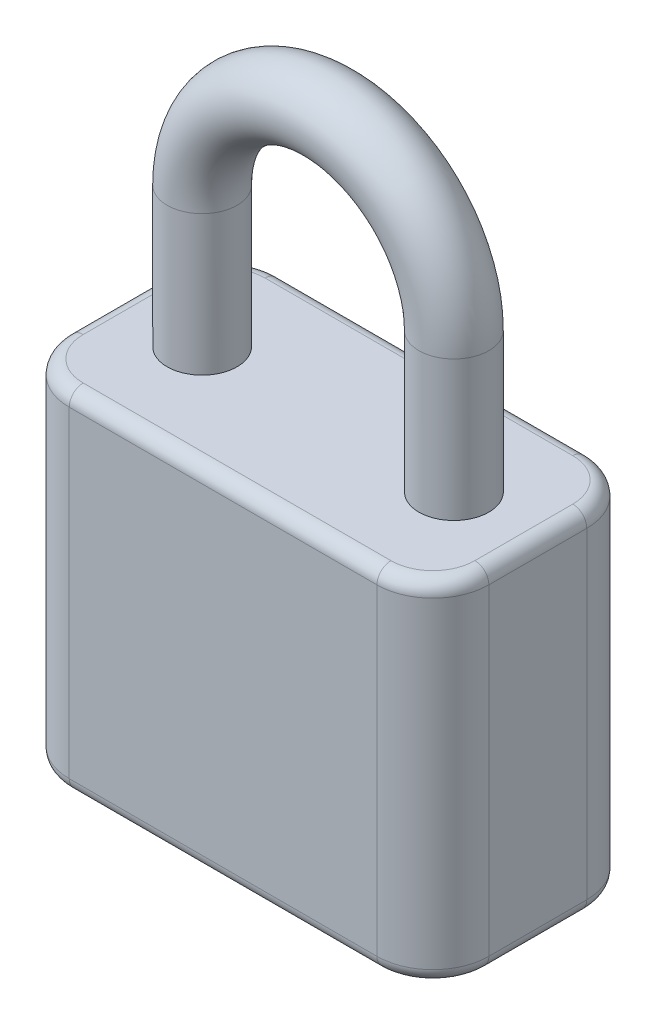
ISO-10303-21;
HEADER;
FILE_DESCRIPTION(('STEP AP214'),'2;1');
FILE_NAME('part.step','',(''),(''),'','','');
FILE_SCHEMA(('AUTOMOTIVE_DESIGN { 1 0 10303 214 1 1 1 1 }'));
ENDSEC;
DATA;
#1=APPLICATION_CONTEXT('core data for automotive mechanical design processes');
#2=APPLICATION_PROTOCOL_DEFINITION('international standard','automotive_design',2000,#1);
#3=PRODUCT_CONTEXT('',#1,'mechanical');
#4=PRODUCT('Part','Part','',(#3));
#5=PRODUCT_RELATED_PRODUCT_CATEGORY('part','',(#4));
#6=PRODUCT_DEFINITION_FORMATION('','',#4);
#7=PRODUCT_DEFINITION_CONTEXT('part definition',#1,'design');
#8=PRODUCT_DEFINITION('design','',#6,#7);
#9=PRODUCT_DEFINITION_SHAPE('','',#8);
#10=(LENGTH_UNIT() NAMED_UNIT(*) SI_UNIT(.MILLI.,.METRE.));
#11=(NAMED_UNIT(*) PLANE_ANGLE_UNIT() SI_UNIT($,.RADIAN.));
#12=(NAMED_UNIT(*) SI_UNIT($,.STERADIAN.) SOLID_ANGLE_UNIT());
#13=UNCERTAINTY_MEASURE_WITH_UNIT(LENGTH_MEASURE(1.E-05),#10,'distance_accuracy_value','');
#14=(GEOMETRIC_REPRESENTATION_CONTEXT(3) GLOBAL_UNCERTAINTY_ASSIGNED_CONTEXT((#13)) GLOBAL_UNIT_ASSIGNED_CONTEXT((#10,
#11,#12)) REPRESENTATION_CONTEXT('',''));
#15=CARTESIAN_POINT('',(0.,0.,0.));
#16=DIRECTION('',(0.,0.,1.));
#17=DIRECTION('',(1.,0.,0.));
#18=AXIS2_PLACEMENT_3D('',#15,#16,#17);
#19=CARTESIAN_POINT('',(0.,0.,0.));
#20=DIRECTION('',(0.,-1.,0.));
#21=DIRECTION('',(0.,0.,-1.));
#22=AXIS2_PLACEMENT_3D('',#19,#20,#21);
#23=PLANE('',#22);
#24=DIRECTION('',(1.,0.,0.));
#25=VECTOR('',#24,1.);
#26=CARTESIAN_POINT('',(-27.94,0.,16.51));
#27=LINE('',#26,#25);
#28=CARTESIAN_POINT('',(27.94,0.,16.51));
#29=VERTEX_POINT('',#28);
#30=CARTESIAN_POINT('',(-27.94,0.,16.51));
#31=VERTEX_POINT('',#30);
#32=EDGE_CURVE('E253',#29,#31,#27,.F.);
#33=ORIENTED_EDGE('',*,*,#32,.T.);
#34=CARTESIAN_POINT('',(-27.94,0.,8.89));
#35=DIRECTION('',(0.,-1.,0.));
#36=DIRECTION('',(0.,0.,-1.));
#37=AXIS2_PLACEMENT_3D('',#34,#35,#36);
#38=CIRCLE('',#37,7.62);
#39=CARTESIAN_POINT('',(-35.56,0.,8.89));
#40=VERTEX_POINT('',#39);
#41=EDGE_CURVE('E267',#31,#40,#38,.T.);
#42=ORIENTED_EDGE('',*,*,#41,.T.);
#43=DIRECTION('',(0.,0.,1.));
#44=VECTOR('',#43,1.);
#45=CARTESIAN_POINT('',(-35.56,0.,-8.88999999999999));
#46=LINE('',#45,#44);
#47=CARTESIAN_POINT('',(-35.56,0.,-8.89));
#48=VERTEX_POINT('',#47);
#49=EDGE_CURVE('E265',#40,#48,#46,.F.);
#50=ORIENTED_EDGE('',*,*,#49,.T.);
#51=CARTESIAN_POINT('',(-27.94,0.,-8.89));
#52=DIRECTION('',(0.,-1.,0.));
#53=DIRECTION('',(0.,0.,-1.));
#54=AXIS2_PLACEMENT_3D('',#51,#52,#53);
#55=CIRCLE('',#54,7.62);
#56=CARTESIAN_POINT('',(-27.94,0.,-16.51));
#57=VERTEX_POINT('',#56);
#58=EDGE_CURVE('E263',#48,#57,#55,.T.);
#59=ORIENTED_EDGE('',*,*,#58,.T.);
#60=DIRECTION('',(-1.,0.,0.));
#61=VECTOR('',#60,1.);
#62=CARTESIAN_POINT('',(27.94,0.,-16.51));
#63=LINE('',#62,#61);
#64=CARTESIAN_POINT('',(27.94,0.,-16.51));
#65=VERTEX_POINT('',#64);
#66=EDGE_CURVE('E261',#57,#65,#63,.F.);
#67=ORIENTED_EDGE('',*,*,#66,.T.);
#68=CARTESIAN_POINT('',(27.94,0.,-8.89));
#69=DIRECTION('',(0.,-1.,0.));
#70=DIRECTION('',(0.,0.,-1.));
#71=AXIS2_PLACEMENT_3D('',#68,#69,#70);
#72=CIRCLE('',#71,7.62);
#73=CARTESIAN_POINT('',(35.56,0.,-8.89));
#74=VERTEX_POINT('',#73);
#75=EDGE_CURVE('E259',#65,#74,#72,.T.);
#76=ORIENTED_EDGE('',*,*,#75,.T.);
#77=DIRECTION('',(0.,0.,-1.));
#78=VECTOR('',#77,1.);
#79=CARTESIAN_POINT('',(35.56,0.,8.89000000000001));
#80=LINE('',#79,#78);
#81=CARTESIAN_POINT('',(35.56,0.,8.89));
#82=VERTEX_POINT('',#81);
#83=EDGE_CURVE('E257',#74,#82,#80,.F.);
#84=ORIENTED_EDGE('',*,*,#83,.T.);
#85=CARTESIAN_POINT('',(27.94,0.,8.89));
#86=DIRECTION('',(0.,-1.,0.));
#87=DIRECTION('',(0.,0.,-1.));
#88=AXIS2_PLACEMENT_3D('',#85,#86,#87);
#89=CIRCLE('',#88,7.62);
#90=EDGE_CURVE('E255',#82,#29,#89,.T.);
#91=ORIENTED_EDGE('',*,*,#90,.T.);
#92=EDGE_LOOP('',(#33,#42,#50,#59,#67,#76,#84,#91));
#93=FACE_BOUND('',#92,.T.);
#94=CARTESIAN_POINT('',(0.,0.,0.));
#95=DIRECTION('',(0.,-1.,0.));
#96=DIRECTION('',(0.,0.,-1.));
#97=AXIS2_PLACEMENT_3D('',#94,#95,#96);
#98=CIRCLE('',#97,15.24);
#99=CARTESIAN_POINT('',(0.,0.,-15.24));
#100=VERTEX_POINT('',#99);
#101=EDGE_CURVE('E209',#100,#100,#98,.T.);
#102=ORIENTED_EDGE('',*,*,#101,.F.);
#103=EDGE_LOOP('',(#102));
#104=FACE_BOUND('',#103,.T.);
#105=ADVANCED_FACE('F34',(#93,#104),#23,.T.);
#106=CARTESIAN_POINT('',(0.,63.5,0.));
#107=DIRECTION('',(0.,-1.,0.));
#108=DIRECTION('',(0.,0.,-1.));
#109=AXIS2_PLACEMENT_3D('',#106,#107,#108);
#110=PLANE('',#109);
#111=DIRECTION('',(0.,0.,1.));
#112=VECTOR('',#111,1.);
#113=CARTESIAN_POINT('',(-35.56,63.5,0.));
#114=LINE('',#113,#112);
#115=CARTESIAN_POINT('',(-35.56,63.5,-8.89));
#116=VERTEX_POINT('',#115);
#117=CARTESIAN_POINT('',(-35.56,63.5,8.89));
#118=VERTEX_POINT('',#117);
#119=EDGE_CURVE('E59',#116,#118,#114,.T.);
#120=ORIENTED_EDGE('',*,*,#119,.T.);
#121=CARTESIAN_POINT('',(-27.94,63.5,8.89));
#122=DIRECTION('',(0.,-1.,0.));
#123=DIRECTION('',(0.,0.,-1.));
#124=AXIS2_PLACEMENT_3D('',#121,#122,#123);
#125=CIRCLE('',#124,7.62);
#126=CARTESIAN_POINT('',(-27.94,63.5,16.51));
#127=VERTEX_POINT('',#126);
#128=EDGE_CURVE('E313',#118,#127,#125,.F.);
#129=ORIENTED_EDGE('',*,*,#128,.T.);
#130=DIRECTION('',(1.,0.,0.));
#131=VECTOR('',#130,1.);
#132=CARTESIAN_POINT('',(0.,63.5,16.51));
#133=LINE('',#132,#131);
#134=CARTESIAN_POINT('',(27.94,63.5,16.51));
#135=VERTEX_POINT('',#134);
#136=EDGE_CURVE('E300',#127,#135,#133,.T.);
#137=ORIENTED_EDGE('',*,*,#136,.T.);
#138=CARTESIAN_POINT('',(27.94,63.5,8.89));
#139=DIRECTION('',(0.,-1.,0.));
#140=DIRECTION('',(0.,0.,-1.));
#141=AXIS2_PLACEMENT_3D('',#138,#139,#140);
#142=CIRCLE('',#141,7.62);
#143=CARTESIAN_POINT('',(35.56,63.5,8.89));
#144=VERTEX_POINT('',#143);
#145=EDGE_CURVE('E302',#135,#144,#142,.F.);
#146=ORIENTED_EDGE('',*,*,#145,.T.);
#147=DIRECTION('',(0.,0.,-1.));
#148=VECTOR('',#147,1.);
#149=CARTESIAN_POINT('',(35.56,63.5,0.));
#150=LINE('',#149,#148);
#151=CARTESIAN_POINT('',(35.56,63.5,-8.89));
#152=VERTEX_POINT('',#151);
#153=EDGE_CURVE('E304',#144,#152,#150,.T.);
#154=ORIENTED_EDGE('',*,*,#153,.T.);
#155=CARTESIAN_POINT('',(27.94,63.5,-8.89));
#156=DIRECTION('',(0.,-1.,0.));
#157=DIRECTION('',(0.,0.,-1.));
#158=AXIS2_PLACEMENT_3D('',#155,#156,#157);
#159=CIRCLE('',#158,7.62);
#160=CARTESIAN_POINT('',(27.94,63.5,-16.51));
#161=VERTEX_POINT('',#160);
#162=EDGE_CURVE('E306',#152,#161,#159,.F.);
#163=ORIENTED_EDGE('',*,*,#162,.T.);
#164=DIRECTION('',(-1.,0.,0.));
#165=VECTOR('',#164,1.);
#166=CARTESIAN_POINT('',(0.,63.5,-16.51));
#167=LINE('',#166,#165);
#168=CARTESIAN_POINT('',(-27.94,63.5,-16.51));
#169=VERTEX_POINT('',#168);
#170=EDGE_CURVE('E308',#161,#169,#167,.T.);
#171=ORIENTED_EDGE('',*,*,#170,.T.);
#172=CARTESIAN_POINT('',(-27.94,63.5,-8.89));
#173=DIRECTION('',(0.,-1.,0.));
#174=DIRECTION('',(0.,0.,-1.));
#175=AXIS2_PLACEMENT_3D('',#172,#173,#174);
#176=CIRCLE('',#175,7.62);
#177=EDGE_CURVE('E310',#169,#116,#176,.F.);
#178=ORIENTED_EDGE('',*,*,#177,.T.);
#179=EDGE_LOOP('',(#120,#129,#137,#146,#154,#163,#171,#178));
#180=FACE_BOUND('',#179,.T.);
#181=CARTESIAN_POINT('',(22.86,63.5,0.));
#182=DIRECTION('',(0.,-1.,0.));
#183=DIRECTION('',(0.,0.,1.));
#184=AXIS2_PLACEMENT_3D('',#181,#182,#183);
#185=CIRCLE('',#184,6.35);
#186=CARTESIAN_POINT('',(22.86,63.5,6.35));
#187=VERTEX_POINT('',#186);
#188=EDGE_CURVE('E224',#187,#187,#185,.T.);
#189=ORIENTED_EDGE('',*,*,#188,.T.);
#190=EDGE_LOOP('',(#189));
#191=FACE_BOUND('',#190,.T.);
#192=CARTESIAN_POINT('',(-22.86,63.5,0.));
#193=DIRECTION('',(0.,1.,0.));
#194=DIRECTION('',(0.,0.,1.));
#195=AXIS2_PLACEMENT_3D('',#192,#193,#194);
#196=CIRCLE('',#195,6.35);
#197=CARTESIAN_POINT('',(-22.86,63.5,6.35));
#198=VERTEX_POINT('',#197);
#199=EDGE_CURVE('E11',#198,#198,#196,.T.);
#200=ORIENTED_EDGE('',*,*,#199,.F.);
#201=EDGE_LOOP('',(#200));
#202=FACE_BOUND('',#201,.T.);
#203=ADVANCED_FACE('F458',(#180,#191,#202),#110,.F.);
#204=CARTESIAN_POINT('',(38.1,63.5,19.05));
#205=DIRECTION('',(-1.,0.,0.));
#206=DIRECTION('',(0.,0.,1.));
#207=AXIS2_PLACEMENT_3D('',#204,#205,#206);
#208=PLANE('',#207);
#209=DIRECTION('',(0.,-1.,0.));
#210=VECTOR('',#209,1.);
#211=CARTESIAN_POINT('',(38.1,63.5,8.89));
#212=LINE('',#211,#210);
#213=CARTESIAN_POINT('',(38.1,60.96,8.89));
#214=VERTEX_POINT('',#213);
#215=CARTESIAN_POINT('',(38.1,2.54,8.89));
#216=VERTEX_POINT('',#215);
#217=EDGE_CURVE('E235',#214,#216,#212,.T.);
#218=ORIENTED_EDGE('',*,*,#217,.T.);
#219=DIRECTION('',(0.,0.,-1.));
#220=VECTOR('',#219,1.);
#221=CARTESIAN_POINT('',(38.1,2.54,-8.88999999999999));
#222=LINE('',#221,#220);
#223=CARTESIAN_POINT('',(38.1,2.54,-8.89));
#224=VERTEX_POINT('',#223);
#225=EDGE_CURVE('E294',#216,#224,#222,.T.);
#226=ORIENTED_EDGE('',*,*,#225,.T.);
#227=DIRECTION('',(0.,-1.,0.));
#228=VECTOR('',#227,1.);
#229=CARTESIAN_POINT('',(38.1,63.5,-8.89));
#230=LINE('',#229,#228);
#231=CARTESIAN_POINT('',(38.1,60.96,-8.89));
#232=VERTEX_POINT('',#231);
#233=EDGE_CURVE('E238',#224,#232,#230,.F.);
#234=ORIENTED_EDGE('',*,*,#233,.T.);
#235=DIRECTION('',(0.,0.,-1.));
#236=VECTOR('',#235,1.);
#237=CARTESIAN_POINT('',(38.1,60.96,19.05));
#238=LINE('',#237,#236);
#239=EDGE_CURVE('E292',#232,#214,#238,.F.);
#240=ORIENTED_EDGE('',*,*,#239,.T.);
#241=EDGE_LOOP('',(#218,#226,#234,#240));
#242=FACE_BOUND('',#241,.T.);
#243=ADVANCED_FACE('F375',(#242),#208,.F.);
#244=CARTESIAN_POINT('',(-38.1,63.5,-19.05));
#245=DIRECTION('',(0.,0.,1.));
#246=DIRECTION('',(1.,0.,0.));
#247=AXIS2_PLACEMENT_3D('',#244,#245,#246);
#248=PLANE('',#247);
#249=DIRECTION('',(0.,-1.,0.));
#250=VECTOR('',#249,1.);
#251=CARTESIAN_POINT('',(27.94,63.5,-19.05));
#252=LINE('',#251,#250);
#253=CARTESIAN_POINT('',(27.94,60.96,-19.05));
#254=VERTEX_POINT('',#253);
#255=CARTESIAN_POINT('',(27.94,2.54,-19.05));
#256=VERTEX_POINT('',#255);
#257=EDGE_CURVE('E231',#254,#256,#252,.T.);
#258=ORIENTED_EDGE('',*,*,#257,.T.);
#259=DIRECTION('',(-1.,0.,0.));
#260=VECTOR('',#259,1.);
#261=CARTESIAN_POINT('',(-27.94,2.54,-19.05));
#262=LINE('',#261,#260);
#263=CARTESIAN_POINT('',(-27.94,2.54,-19.05));
#264=VERTEX_POINT('',#263);
#265=EDGE_CURVE('E286',#256,#264,#262,.T.);
#266=ORIENTED_EDGE('',*,*,#265,.T.);
#267=DIRECTION('',(0.,-1.,0.));
#268=VECTOR('',#267,1.);
#269=CARTESIAN_POINT('',(-27.94,63.5,-19.05));
#270=LINE('',#269,#268);
#271=CARTESIAN_POINT('',(-27.94,60.96,-19.05));
#272=VERTEX_POINT('',#271);
#273=EDGE_CURVE('E228',#264,#272,#270,.F.);
#274=ORIENTED_EDGE('',*,*,#273,.T.);
#275=DIRECTION('',(-1.,0.,0.));
#276=VECTOR('',#275,1.);
#277=CARTESIAN_POINT('',(-38.1,60.96,-19.05));
#278=LINE('',#277,#276);
#279=EDGE_CURVE('E284',#272,#254,#278,.F.);
#280=ORIENTED_EDGE('',*,*,#279,.T.);
#281=EDGE_LOOP('',(#258,#266,#274,#280));
#282=FACE_BOUND('',#281,.T.);
#283=ADVANCED_FACE('F399',(#282),#248,.F.);
#284=CARTESIAN_POINT('',(-38.1,63.5,19.05));
#285=DIRECTION('',(1.,0.,0.));
#286=DIRECTION('',(0.,0.,-1.));
#287=AXIS2_PLACEMENT_3D('',#284,#285,#286);
#288=PLANE('',#287);
#289=DIRECTION('',(0.,-1.,0.));
#290=VECTOR('',#289,1.);
#291=CARTESIAN_POINT('',(-38.1,63.5,-8.89));
#292=LINE('',#291,#290);
#293=CARTESIAN_POINT('',(-38.1,60.96,-8.89));
#294=VERTEX_POINT('',#293);
#295=CARTESIAN_POINT('',(-38.1,2.54,-8.89));
#296=VERTEX_POINT('',#295);
#297=EDGE_CURVE('E244',#294,#296,#292,.T.);
#298=ORIENTED_EDGE('',*,*,#297,.T.);
#299=DIRECTION('',(0.,0.,1.));
#300=VECTOR('',#299,1.);
#301=CARTESIAN_POINT('',(-38.1,2.54,8.89000000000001));
#302=LINE('',#301,#300);
#303=CARTESIAN_POINT('',(-38.1,2.54,8.89));
#304=VERTEX_POINT('',#303);
#305=EDGE_CURVE('E278',#296,#304,#302,.T.);
#306=ORIENTED_EDGE('',*,*,#305,.T.);
#307=DIRECTION('',(0.,-1.,0.));
#308=VECTOR('',#307,1.);
#309=CARTESIAN_POINT('',(-38.1,63.5,8.89));
#310=LINE('',#309,#308);
#311=CARTESIAN_POINT('',(-38.1,60.96,8.89));
#312=VERTEX_POINT('',#311);
#313=EDGE_CURVE('E241',#304,#312,#310,.F.);
#314=ORIENTED_EDGE('',*,*,#313,.T.);
#315=DIRECTION('',(0.,0.,1.));
#316=VECTOR('',#315,1.);
#317=CARTESIAN_POINT('',(-38.1,60.96,19.05));
#318=LINE('',#317,#316);
#319=EDGE_CURVE('E276',#312,#294,#318,.F.);
#320=ORIENTED_EDGE('',*,*,#319,.T.);
#321=EDGE_LOOP('',(#298,#306,#314,#320));
#322=FACE_BOUND('',#321,.T.);
#323=ADVANCED_FACE('F420',(#322),#288,.F.);
#324=CARTESIAN_POINT('',(-38.1,63.5,19.05));
#325=DIRECTION('',(0.,0.,-1.));
#326=DIRECTION('',(-1.,0.,0.));
#327=AXIS2_PLACEMENT_3D('',#324,#325,#326);
#328=PLANE('',#327);
#329=DIRECTION('',(0.,-1.,0.));
#330=VECTOR('',#329,1.);
#331=CARTESIAN_POINT('',(-27.94,63.5,19.05));
#332=LINE('',#331,#330);
#333=CARTESIAN_POINT('',(-27.94,60.96,19.05));
#334=VERTEX_POINT('',#333);
#335=CARTESIAN_POINT('',(-27.94,2.54,19.05));
#336=VERTEX_POINT('',#335);
#337=EDGE_CURVE('E250',#334,#336,#332,.T.);
#338=ORIENTED_EDGE('',*,*,#337,.T.);
#339=DIRECTION('',(1.,0.,0.));
#340=VECTOR('',#339,1.);
#341=CARTESIAN_POINT('',(27.94,2.54,19.05));
#342=LINE('',#341,#340);
#343=CARTESIAN_POINT('',(27.94,2.54,19.05));
#344=VERTEX_POINT('',#343);
#345=EDGE_CURVE('E43',#336,#344,#342,.T.);
#346=ORIENTED_EDGE('',*,*,#345,.T.);
#347=DIRECTION('',(0.,-1.,0.));
#348=VECTOR('',#347,1.);
#349=CARTESIAN_POINT('',(27.94,63.5,19.05));
#350=LINE('',#349,#348);
#351=CARTESIAN_POINT('',(27.94,60.96,19.05));
#352=VERTEX_POINT('',#351);
#353=EDGE_CURVE('E247',#344,#352,#350,.F.);
#354=ORIENTED_EDGE('',*,*,#353,.T.);
#355=DIRECTION('',(1.,0.,0.));
#356=VECTOR('',#355,1.);
#357=CARTESIAN_POINT('',(-38.1,60.96,19.05));
#358=LINE('',#357,#356);
#359=EDGE_CURVE('E315',#352,#334,#358,.F.);
#360=ORIENTED_EDGE('',*,*,#359,.T.);
#361=EDGE_LOOP('',(#338,#346,#354,#360));
#362=FACE_BOUND('',#361,.T.);
#363=ADVANCED_FACE('F434',(#362),#328,.F.);
#364=CARTESIAN_POINT('',(27.94,63.5,-8.89));
#365=DIRECTION('',(0.,-1.,0.));
#366=DIRECTION('',(0.,0.,-1.));
#367=AXIS2_PLACEMENT_3D('',#364,#365,#366);
#368=CYLINDRICAL_SURFACE('',#367,10.16);
#369=ORIENTED_EDGE('',*,*,#233,.F.);
#370=CARTESIAN_POINT('',(27.94,2.54,-8.89));
#371=DIRECTION('',(0.,-1.,0.));
#372=DIRECTION('',(0.,0.,-1.));
#373=AXIS2_PLACEMENT_3D('',#370,#371,#372);
#374=CIRCLE('',#373,10.16);
#375=EDGE_CURVE('E290',#224,#256,#374,.F.);
#376=ORIENTED_EDGE('',*,*,#375,.T.);
#377=ORIENTED_EDGE('',*,*,#257,.F.);
#378=CARTESIAN_POINT('',(27.94,60.96,-8.89));
#379=DIRECTION('',(0.,-1.,0.));
#380=DIRECTION('',(0.,0.,-1.));
#381=AXIS2_PLACEMENT_3D('',#378,#379,#380);
#382=CIRCLE('',#381,10.16);
#383=EDGE_CURVE('E288',#254,#232,#382,.T.);
#384=ORIENTED_EDGE('',*,*,#383,.T.);
#385=EDGE_LOOP('',(#369,#376,#377,#384));
#386=FACE_BOUND('',#385,.T.);
#387=ADVANCED_FACE('F372',(#386),#368,.T.);
#388=CARTESIAN_POINT('',(-27.94,63.5,-8.89));
#389=DIRECTION('',(0.,-1.,0.));
#390=DIRECTION('',(0.,0.,-1.));
#391=AXIS2_PLACEMENT_3D('',#388,#389,#390);
#392=CYLINDRICAL_SURFACE('',#391,10.16);
#393=ORIENTED_EDGE('',*,*,#273,.F.);
#394=CARTESIAN_POINT('',(-27.94,2.54,-8.89));
#395=DIRECTION('',(0.,-1.,0.));
#396=DIRECTION('',(0.,0.,-1.));
#397=AXIS2_PLACEMENT_3D('',#394,#395,#396);
#398=CIRCLE('',#397,10.16);
#399=EDGE_CURVE('E282',#264,#296,#398,.F.);
#400=ORIENTED_EDGE('',*,*,#399,.T.);
#401=ORIENTED_EDGE('',*,*,#297,.F.);
#402=CARTESIAN_POINT('',(-27.94,60.96,-8.89));
#403=DIRECTION('',(0.,-1.,0.));
#404=DIRECTION('',(0.,0.,-1.));
#405=AXIS2_PLACEMENT_3D('',#402,#403,#404);
#406=CIRCLE('',#405,10.16);
#407=EDGE_CURVE('E280',#294,#272,#406,.T.);
#408=ORIENTED_EDGE('',*,*,#407,.T.);
#409=EDGE_LOOP('',(#393,#400,#401,#408));
#410=FACE_BOUND('',#409,.T.);
#411=ADVANCED_FACE('F403',(#410),#392,.T.);
#412=CARTESIAN_POINT('',(-27.94,63.5,8.89));
#413=DIRECTION('',(0.,-1.,0.));
#414=DIRECTION('',(0.,0.,-1.));
#415=AXIS2_PLACEMENT_3D('',#412,#413,#414);
#416=CYLINDRICAL_SURFACE('',#415,10.16);
#417=ORIENTED_EDGE('',*,*,#313,.F.);
#418=CARTESIAN_POINT('',(-27.94,2.54,8.89));
#419=DIRECTION('',(0.,-1.,0.));
#420=DIRECTION('',(0.,0.,-1.));
#421=AXIS2_PLACEMENT_3D('',#418,#419,#420);
#422=CIRCLE('',#421,10.16);
#423=EDGE_CURVE('E273',#304,#336,#422,.F.);
#424=ORIENTED_EDGE('',*,*,#423,.T.);
#425=ORIENTED_EDGE('',*,*,#337,.F.);
#426=CARTESIAN_POINT('',(-27.94,60.96,8.89));
#427=DIRECTION('',(0.,-1.,0.));
#428=DIRECTION('',(0.,0.,-1.));
#429=AXIS2_PLACEMENT_3D('',#426,#427,#428);
#430=CIRCLE('',#429,10.16);
#431=EDGE_CURVE('E270',#334,#312,#430,.T.);
#432=ORIENTED_EDGE('',*,*,#431,.T.);
#433=EDGE_LOOP('',(#417,#424,#425,#432));
#434=FACE_BOUND('',#433,.T.);
#435=ADVANCED_FACE('F423',(#434),#416,.T.);
#436=CARTESIAN_POINT('',(27.94,63.5,8.89));
#437=DIRECTION('',(0.,-1.,0.));
#438=DIRECTION('',(0.,0.,-1.));
#439=AXIS2_PLACEMENT_3D('',#436,#437,#438);
#440=CYLINDRICAL_SURFACE('',#439,10.16);
#441=ORIENTED_EDGE('',*,*,#353,.F.);
#442=CARTESIAN_POINT('',(27.94,2.54,8.89));
#443=DIRECTION('',(0.,-1.,0.));
#444=DIRECTION('',(0.,0.,-1.));
#445=AXIS2_PLACEMENT_3D('',#442,#443,#444);
#446=CIRCLE('',#445,10.16);
#447=EDGE_CURVE('E298',#344,#216,#446,.F.);
#448=ORIENTED_EDGE('',*,*,#447,.T.);
#449=ORIENTED_EDGE('',*,*,#217,.F.);
#450=CARTESIAN_POINT('',(27.94,60.96,8.89));
#451=DIRECTION('',(0.,-1.,0.));
#452=DIRECTION('',(0.,0.,-1.));
#453=AXIS2_PLACEMENT_3D('',#450,#451,#452);
#454=CIRCLE('',#453,10.16);
#455=EDGE_CURVE('E296',#214,#352,#454,.T.);
#456=ORIENTED_EDGE('',*,*,#455,.T.);
#457=EDGE_LOOP('',(#441,#448,#449,#456));
#458=FACE_BOUND('',#457,.T.);
#459=ADVANCED_FACE('F437',(#458),#440,.T.);
#460=CARTESIAN_POINT('',(27.94,2.54,-8.89));
#461=DIRECTION('',(0.,-1.,0.));
#462=DIRECTION('',(0.,0.,-1.));
#463=AXIS2_PLACEMENT_3D('',#460,#461,#462);
#464=TOROIDAL_SURFACE('',#463,7.62,2.54);
#465=CARTESIAN_POINT('',(27.94,2.54,-16.51));
#466=DIRECTION('',(-1.,0.,0.));
#467=DIRECTION('',(0.,0.,1.));
#468=AXIS2_PLACEMENT_3D('',#465,#466,#467);
#469=CIRCLE('',#468,2.54);
#470=EDGE_CURVE('E334',#256,#65,#469,.T.);
#471=ORIENTED_EDGE('',*,*,#470,.F.);
#472=ORIENTED_EDGE('',*,*,#375,.F.);
#473=CARTESIAN_POINT('',(35.56,2.54,-8.89));
#474=DIRECTION('',(0.,0.,1.));
#475=DIRECTION('',(1.,0.,0.));
#476=AXIS2_PLACEMENT_3D('',#473,#474,#475);
#477=CIRCLE('',#476,2.54);
#478=EDGE_CURVE('E232',#74,#224,#477,.T.);
#479=ORIENTED_EDGE('',*,*,#478,.F.);
#480=ORIENTED_EDGE('',*,*,#75,.F.);
#481=EDGE_LOOP('',(#471,#472,#479,#480));
#482=FACE_BOUND('',#481,.T.);
#483=ADVANCED_FACE('F396',(#482),#464,.T.);
#484=CARTESIAN_POINT('',(35.56,2.54,19.05));
#485=DIRECTION('',(0.,0.,1.));
#486=DIRECTION('',(1.,0.,0.));
#487=AXIS2_PLACEMENT_3D('',#484,#485,#486);
#488=CYLINDRICAL_SURFACE('',#487,2.54);
#489=ORIENTED_EDGE('',*,*,#478,.T.);
#490=ORIENTED_EDGE('',*,*,#225,.F.);
#491=CARTESIAN_POINT('',(35.56,2.54,8.89));
#492=DIRECTION('',(0.,0.,1.));
#493=DIRECTION('',(1.,0.,0.));
#494=AXIS2_PLACEMENT_3D('',#491,#492,#493);
#495=CIRCLE('',#494,2.54);
#496=EDGE_CURVE('E331',#82,#216,#495,.T.);
#497=ORIENTED_EDGE('',*,*,#496,.F.);
#498=ORIENTED_EDGE('',*,*,#83,.F.);
#499=EDGE_LOOP('',(#489,#490,#497,#498));
#500=FACE_BOUND('',#499,.T.);
#501=ADVANCED_FACE('F380',(#500),#488,.T.);
#502=CARTESIAN_POINT('',(-38.1,2.54,-16.51));
#503=DIRECTION('',(1.,0.,0.));
#504=DIRECTION('',(0.,0.,-1.));
#505=AXIS2_PLACEMENT_3D('',#502,#503,#504);
#506=CYLINDRICAL_SURFACE('',#505,2.54);
#507=ORIENTED_EDGE('',*,*,#470,.T.);
#508=ORIENTED_EDGE('',*,*,#66,.F.);
#509=CARTESIAN_POINT('',(-27.94,2.54,-16.51));
#510=DIRECTION('',(-1.,0.,0.));
#511=DIRECTION('',(0.,0.,1.));
#512=AXIS2_PLACEMENT_3D('',#509,#510,#511);
#513=CIRCLE('',#512,2.54);
#514=EDGE_CURVE('E328',#264,#57,#513,.T.);
#515=ORIENTED_EDGE('',*,*,#514,.F.);
#516=ORIENTED_EDGE('',*,*,#265,.F.);
#517=EDGE_LOOP('',(#507,#508,#515,#516));
#518=FACE_BOUND('',#517,.T.);
#519=ADVANCED_FACE('F408',(#518),#506,.T.);
#520=CARTESIAN_POINT('',(27.94,2.54,8.89));
#521=DIRECTION('',(0.,-1.,0.));
#522=DIRECTION('',(0.,0.,-1.));
#523=AXIS2_PLACEMENT_3D('',#520,#521,#522);
#524=TOROIDAL_SURFACE('',#523,7.62,2.54);
#525=ORIENTED_EDGE('',*,*,#496,.T.);
#526=ORIENTED_EDGE('',*,*,#447,.F.);
#527=CARTESIAN_POINT('',(27.94,2.54,16.51));
#528=DIRECTION('',(-1.,0.,0.));
#529=DIRECTION('',(0.,0.,1.));
#530=AXIS2_PLACEMENT_3D('',#527,#528,#529);
#531=CIRCLE('',#530,2.54);
#532=EDGE_CURVE('E325',#29,#344,#531,.T.);
#533=ORIENTED_EDGE('',*,*,#532,.F.);
#534=ORIENTED_EDGE('',*,*,#90,.F.);
#535=EDGE_LOOP('',(#525,#526,#533,#534));
#536=FACE_BOUND('',#535,.T.);
#537=ADVANCED_FACE('F386',(#536),#524,.T.);
#538=CARTESIAN_POINT('',(-27.94,2.54,-8.89));
#539=DIRECTION('',(0.,-1.,0.));
#540=DIRECTION('',(0.,0.,-1.));
#541=AXIS2_PLACEMENT_3D('',#538,#539,#540);
#542=TOROIDAL_SURFACE('',#541,7.62,2.54);
#543=ORIENTED_EDGE('',*,*,#514,.T.);
#544=ORIENTED_EDGE('',*,*,#58,.F.);
#545=CARTESIAN_POINT('',(-35.56,2.54,-8.89));
#546=DIRECTION('',(0.,0.,1.));
#547=DIRECTION('',(1.,0.,0.));
#548=AXIS2_PLACEMENT_3D('',#545,#546,#547);
#549=CIRCLE('',#548,2.54);
#550=EDGE_CURVE('E322',#296,#48,#549,.T.);
#551=ORIENTED_EDGE('',*,*,#550,.F.);
#552=ORIENTED_EDGE('',*,*,#399,.F.);
#553=EDGE_LOOP('',(#543,#544,#551,#552));
#554=FACE_BOUND('',#553,.T.);
#555=ADVANCED_FACE('F412',(#554),#542,.T.);
#556=CARTESIAN_POINT('',(-38.1,2.54,16.51));
#557=DIRECTION('',(-1.,0.,0.));
#558=DIRECTION('',(0.,0.,1.));
#559=AXIS2_PLACEMENT_3D('',#556,#557,#558);
#560=CYLINDRICAL_SURFACE('',#559,2.54);
#561=ORIENTED_EDGE('',*,*,#532,.T.);
#562=ORIENTED_EDGE('',*,*,#345,.F.);
#563=CARTESIAN_POINT('',(-27.94,2.54,16.51));
#564=DIRECTION('',(-1.,0.,0.));
#565=DIRECTION('',(0.,0.,1.));
#566=AXIS2_PLACEMENT_3D('',#563,#564,#565);
#567=CIRCLE('',#566,2.54);
#568=EDGE_CURVE('E320',#31,#336,#567,.T.);
#569=ORIENTED_EDGE('',*,*,#568,.F.);
#570=ORIENTED_EDGE('',*,*,#32,.F.);
#571=EDGE_LOOP('',(#561,#562,#569,#570));
#572=FACE_BOUND('',#571,.T.);
#573=ADVANCED_FACE('F431',(#572),#560,.T.);
#574=CARTESIAN_POINT('',(-35.56,2.54,19.05));
#575=DIRECTION('',(0.,0.,-1.));
#576=DIRECTION('',(-1.,0.,0.));
#577=AXIS2_PLACEMENT_3D('',#574,#575,#576);
#578=CYLINDRICAL_SURFACE('',#577,2.54);
#579=ORIENTED_EDGE('',*,*,#550,.T.);
#580=ORIENTED_EDGE('',*,*,#49,.F.);
#581=CARTESIAN_POINT('',(-35.56,2.54,8.89));
#582=DIRECTION('',(0.,0.,1.));
#583=DIRECTION('',(1.,0.,0.));
#584=AXIS2_PLACEMENT_3D('',#581,#582,#583);
#585=CIRCLE('',#584,2.54);
#586=EDGE_CURVE('E318',#304,#40,#585,.T.);
#587=ORIENTED_EDGE('',*,*,#586,.F.);
#588=ORIENTED_EDGE('',*,*,#305,.F.);
#589=EDGE_LOOP('',(#579,#580,#587,#588));
#590=FACE_BOUND('',#589,.T.);
#591=ADVANCED_FACE('F417',(#590),#578,.T.);
#592=CARTESIAN_POINT('',(-27.94,2.54,8.89));
#593=DIRECTION('',(0.,-1.,0.));
#594=DIRECTION('',(0.,0.,-1.));
#595=AXIS2_PLACEMENT_3D('',#592,#593,#594);
#596=TOROIDAL_SURFACE('',#595,7.62,2.54);
#597=ORIENTED_EDGE('',*,*,#568,.T.);
#598=ORIENTED_EDGE('',*,*,#423,.F.);
#599=ORIENTED_EDGE('',*,*,#586,.T.);
#600=ORIENTED_EDGE('',*,*,#41,.F.);
#601=EDGE_LOOP('',(#597,#598,#599,#600));
#602=FACE_BOUND('',#601,.T.);
#603=ADVANCED_FACE('F427',(#602),#596,.T.);
#604=CARTESIAN_POINT('',(27.94,60.96,-8.89));
#605=DIRECTION('',(0.,-1.,0.));
#606=DIRECTION('',(0.,0.,-1.));
#607=AXIS2_PLACEMENT_3D('',#604,#605,#606);
#608=TOROIDAL_SURFACE('',#607,7.62,2.54);
#609=CARTESIAN_POINT('',(35.56,60.96,-8.89));
#610=DIRECTION('',(0.,0.,1.));
#611=DIRECTION('',(1.,0.,0.));
#612=AXIS2_PLACEMENT_3D('',#609,#610,#611);
#613=CIRCLE('',#612,2.54);
#614=EDGE_CURVE('E353',#232,#152,#613,.T.);
#615=ORIENTED_EDGE('',*,*,#614,.F.);
#616=ORIENTED_EDGE('',*,*,#383,.F.);
#617=CARTESIAN_POINT('',(27.94,60.96,-16.51));
#618=DIRECTION('',(-1.,0.,0.));
#619=DIRECTION('',(0.,0.,1.));
#620=AXIS2_PLACEMENT_3D('',#617,#618,#619);
#621=CIRCLE('',#620,2.54);
#622=EDGE_CURVE('E38',#161,#254,#621,.T.);
#623=ORIENTED_EDGE('',*,*,#622,.F.);
#624=ORIENTED_EDGE('',*,*,#162,.F.);
#625=EDGE_LOOP('',(#615,#616,#623,#624));
#626=FACE_BOUND('',#625,.T.);
#627=ADVANCED_FACE('F36',(#626),#608,.T.);
#628=CARTESIAN_POINT('',(0.,60.96,-16.51));
#629=DIRECTION('',(-1.,0.,0.));
#630=DIRECTION('',(0.,0.,1.));
#631=AXIS2_PLACEMENT_3D('',#628,#629,#630);
#632=CYLINDRICAL_SURFACE('',#631,2.54);
#633=ORIENTED_EDGE('',*,*,#622,.T.);
#634=ORIENTED_EDGE('',*,*,#279,.F.);
#635=CARTESIAN_POINT('',(-27.94,60.96,-16.51));
#636=DIRECTION('',(-1.,0.,0.));
#637=DIRECTION('',(0.,0.,1.));
#638=AXIS2_PLACEMENT_3D('',#635,#636,#637);
#639=CIRCLE('',#638,2.54);
#640=EDGE_CURVE('E351',#169,#272,#639,.T.);
#641=ORIENTED_EDGE('',*,*,#640,.F.);
#642=ORIENTED_EDGE('',*,*,#170,.F.);
#643=EDGE_LOOP('',(#633,#634,#641,#642));
#644=FACE_BOUND('',#643,.T.);
#645=ADVANCED_FACE('F364',(#644),#632,.T.);
#646=CARTESIAN_POINT('',(35.56,60.96,0.));
#647=DIRECTION('',(0.,0.,-1.));
#648=DIRECTION('',(-1.,0.,0.));
#649=AXIS2_PLACEMENT_3D('',#646,#647,#648);
#650=CYLINDRICAL_SURFACE('',#649,2.54);
#651=ORIENTED_EDGE('',*,*,#614,.T.);
#652=ORIENTED_EDGE('',*,*,#153,.F.);
#653=CARTESIAN_POINT('',(35.56,60.96,8.89));
#654=DIRECTION('',(0.,0.,1.));
#655=DIRECTION('',(1.,0.,0.));
#656=AXIS2_PLACEMENT_3D('',#653,#654,#655);
#657=CIRCLE('',#656,2.54);
#658=EDGE_CURVE('E348',#214,#144,#657,.T.);
#659=ORIENTED_EDGE('',*,*,#658,.F.);
#660=ORIENTED_EDGE('',*,*,#239,.F.);
#661=EDGE_LOOP('',(#651,#652,#659,#660));
#662=FACE_BOUND('',#661,.T.);
#663=ADVANCED_FACE('F460',(#662),#650,.T.);
#664=CARTESIAN_POINT('',(-27.94,60.96,-8.89));
#665=DIRECTION('',(0.,-1.,0.));
#666=DIRECTION('',(0.,0.,-1.));
#667=AXIS2_PLACEMENT_3D('',#664,#665,#666);
#668=TOROIDAL_SURFACE('',#667,7.62,2.54);
#669=ORIENTED_EDGE('',*,*,#640,.T.);
#670=ORIENTED_EDGE('',*,*,#407,.F.);
#671=CARTESIAN_POINT('',(-35.56,60.96,-8.89));
#672=DIRECTION('',(0.,0.,1.));
#673=DIRECTION('',(1.,0.,0.));
#674=AXIS2_PLACEMENT_3D('',#671,#672,#673);
#675=CIRCLE('',#674,2.54);
#676=EDGE_CURVE('E345',#116,#294,#675,.T.);
#677=ORIENTED_EDGE('',*,*,#676,.F.);
#678=ORIENTED_EDGE('',*,*,#177,.F.);
#679=EDGE_LOOP('',(#669,#670,#677,#678));
#680=FACE_BOUND('',#679,.T.);
#681=ADVANCED_FACE('F456',(#680),#668,.T.);
#682=CARTESIAN_POINT('',(27.94,60.96,8.89));
#683=DIRECTION('',(0.,-1.,0.));
#684=DIRECTION('',(0.,0.,-1.));
#685=AXIS2_PLACEMENT_3D('',#682,#683,#684);
#686=TOROIDAL_SURFACE('',#685,7.62,2.54);
#687=ORIENTED_EDGE('',*,*,#658,.T.);
#688=ORIENTED_EDGE('',*,*,#145,.F.);
#689=CARTESIAN_POINT('',(27.94,60.96,16.51));
#690=DIRECTION('',(-1.,0.,0.));
#691=DIRECTION('',(0.,0.,1.));
#692=AXIS2_PLACEMENT_3D('',#689,#690,#691);
#693=CIRCLE('',#692,2.54);
#694=EDGE_CURVE('E342',#352,#135,#693,.T.);
#695=ORIENTED_EDGE('',*,*,#694,.F.);
#696=ORIENTED_EDGE('',*,*,#455,.F.);
#697=EDGE_LOOP('',(#687,#688,#695,#696));
#698=FACE_BOUND('',#697,.T.);
#699=ADVANCED_FACE('F441',(#698),#686,.T.);
#700=CARTESIAN_POINT('',(-35.56,60.96,0.));
#701=DIRECTION('',(0.,0.,1.));
#702=DIRECTION('',(1.,0.,0.));
#703=AXIS2_PLACEMENT_3D('',#700,#701,#702);
#704=CYLINDRICAL_SURFACE('',#703,2.54);
#705=ORIENTED_EDGE('',*,*,#676,.T.);
#706=ORIENTED_EDGE('',*,*,#319,.F.);
#707=CARTESIAN_POINT('',(-35.56,60.96,8.89));
#708=DIRECTION('',(0.,0.,1.));
#709=DIRECTION('',(1.,0.,0.));
#710=AXIS2_PLACEMENT_3D('',#707,#708,#709);
#711=CIRCLE('',#710,2.54);
#712=EDGE_CURVE('E340',#118,#312,#711,.T.);
#713=ORIENTED_EDGE('',*,*,#712,.F.);
#714=ORIENTED_EDGE('',*,*,#119,.F.);
#715=EDGE_LOOP('',(#705,#706,#713,#714));
#716=FACE_BOUND('',#715,.T.);
#717=ADVANCED_FACE('F453',(#716),#704,.T.);
#718=CARTESIAN_POINT('',(0.,60.96,16.51));
#719=DIRECTION('',(1.,0.,0.));
#720=DIRECTION('',(0.,0.,-1.));
#721=AXIS2_PLACEMENT_3D('',#718,#719,#720);
#722=CYLINDRICAL_SURFACE('',#721,2.54);
#723=ORIENTED_EDGE('',*,*,#694,.T.);
#724=ORIENTED_EDGE('',*,*,#136,.F.);
#725=CARTESIAN_POINT('',(-27.94,60.96,16.51));
#726=DIRECTION('',(-1.,0.,0.));
#727=DIRECTION('',(0.,0.,1.));
#728=AXIS2_PLACEMENT_3D('',#725,#726,#727);
#729=CIRCLE('',#728,2.54);
#730=EDGE_CURVE('E227',#334,#127,#729,.T.);
#731=ORIENTED_EDGE('',*,*,#730,.F.);
#732=ORIENTED_EDGE('',*,*,#359,.F.);
#733=EDGE_LOOP('',(#723,#724,#731,#732));
#734=FACE_BOUND('',#733,.T.);
#735=ADVANCED_FACE('F447',(#734),#722,.T.);
#736=CARTESIAN_POINT('',(-27.94,60.96,8.89));
#737=DIRECTION('',(0.,-1.,0.));
#738=DIRECTION('',(0.,0.,-1.));
#739=AXIS2_PLACEMENT_3D('',#736,#737,#738);
#740=TOROIDAL_SURFACE('',#739,7.62,2.54);
#741=ORIENTED_EDGE('',*,*,#712,.T.);
#742=ORIENTED_EDGE('',*,*,#431,.F.);
#743=ORIENTED_EDGE('',*,*,#730,.T.);
#744=ORIENTED_EDGE('',*,*,#128,.F.);
#745=EDGE_LOOP('',(#741,#742,#743,#744));
#746=FACE_BOUND('',#745,.T.);
#747=ADVANCED_FACE('F449',(#746),#740,.T.);
#748=CARTESIAN_POINT('',(22.86,88.9,0.));
#749=DIRECTION('',(0.,-1.,0.));
#750=DIRECTION('',(1.,0.,0.));
#751=AXIS2_PLACEMENT_3D('',#748,#749,#750);
#752=CYLINDRICAL_SURFACE('',#751,6.35);
#753=CARTESIAN_POINT('',(22.86,88.9,0.));
#754=DIRECTION('',(0.,-1.,0.));
#755=DIRECTION('',(0.,0.,1.));
#756=AXIS2_PLACEMENT_3D('',#753,#754,#755);
#757=CIRCLE('',#756,6.35);
#758=CARTESIAN_POINT('',(29.21,88.9,0.));
#759=VERTEX_POINT('',#758);
#760=EDGE_CURVE('E220',#759,#759,#757,.T.);
#761=ORIENTED_EDGE('',*,*,#760,.T.);
#762=EDGE_LOOP('',(#761));
#763=FACE_BOUND('',#762,.T.);
#764=ORIENTED_EDGE('',*,*,#188,.F.);
#765=EDGE_LOOP('',(#764));
#766=FACE_BOUND('',#765,.T.);
#767=ADVANCED_FACE('F510',(#763,#766),#752,.T.);
#768=CARTESIAN_POINT('',(0.,88.9,0.));
#769=DIRECTION('',(0.,0.,-1.));
#770=DIRECTION('',(-1.,0.,0.));
#771=AXIS2_PLACEMENT_3D('',#768,#769,#770);
#772=TOROIDAL_SURFACE('',#771,22.86,6.35);
#773=CARTESIAN_POINT('',(-22.86,88.9,0.));
#774=DIRECTION('',(0.,1.,0.));
#775=DIRECTION('',(0.,0.,1.));
#776=AXIS2_PLACEMENT_3D('',#773,#774,#775);
#777=CIRCLE('',#776,6.35);
#778=CARTESIAN_POINT('',(-29.21,88.9,0.));
#779=VERTEX_POINT('',#778);
#780=EDGE_CURVE('E216',#779,#779,#777,.T.);
#781=CARTESIAN_POINT('',(0.,88.9,0.));
#782=DIRECTION('',(0.,0.,-1.));
#783=DIRECTION('',(-1.,0.,0.));
#784=AXIS2_PLACEMENT_3D('',#781,#782,#783);
#785=CIRCLE('',#784,29.21);
#786=EDGE_CURVE('',#779,#759,#785,.T.);
#787=ORIENTED_EDGE('',*,*,#780,.T.);
#788=ORIENTED_EDGE('',*,*,#760,.F.);
#789=ORIENTED_EDGE('',*,*,#786,.T.);
#790=ORIENTED_EDGE('',*,*,#786,.F.);
#791=EDGE_LOOP('',(#787,#789,#788,#790));
#792=FACE_BOUND('',#791,.T.);
#793=ADVANCED_FACE('F539',(#792),#772,.T.);
#794=CARTESIAN_POINT('',(-22.86,88.9,0.));
#795=DIRECTION('',(0.,-1.,0.));
#796=DIRECTION('',(0.,0.,-1.));
#797=AXIS2_PLACEMENT_3D('',#794,#795,#796);
#798=CYLINDRICAL_SURFACE('',#797,6.35);
#799=ORIENTED_EDGE('',*,*,#780,.F.);
#800=EDGE_LOOP('',(#799));
#801=FACE_BOUND('',#800,.T.);
#802=ORIENTED_EDGE('',*,*,#199,.T.);
#803=EDGE_LOOP('',(#802));
#804=FACE_BOUND('',#803,.T.);
#805=ADVANCED_FACE('F546',(#801,#804),#798,.T.);
#806=CARTESIAN_POINT('',(0.,-1.27,0.));
#807=DIRECTION('',(0.,1.,0.));
#808=DIRECTION('',(0.,0.,1.));
#809=AXIS2_PLACEMENT_3D('',#806,#807,#808);
#810=CYLINDRICAL_SURFACE('',#809,15.24);
#811=CARTESIAN_POINT('',(0.,-1.27,0.));
#812=DIRECTION('',(0.,-1.,0.));
#813=DIRECTION('',(0.,0.,-1.));
#814=AXIS2_PLACEMENT_3D('',#811,#812,#813);
#815=CIRCLE('',#814,15.24);
#816=CARTESIAN_POINT('',(0.,-1.27,-15.24));
#817=VERTEX_POINT('',#816);
#818=EDGE_CURVE('E213',#817,#817,#815,.T.);
#819=ORIENTED_EDGE('',*,*,#818,.F.);
#820=EDGE_LOOP('',(#819));
#821=FACE_BOUND('',#820,.T.);
#822=ORIENTED_EDGE('',*,*,#101,.T.);
#823=EDGE_LOOP('',(#822));
#824=FACE_BOUND('',#823,.T.);
#825=ADVANCED_FACE('F554',(#821,#824),#810,.T.);
#826=CARTESIAN_POINT('',(0.,-1.27,0.));
#827=DIRECTION('',(0.,-1.,0.));
#828=DIRECTION('',(0.,0.,-1.));
#829=AXIS2_PLACEMENT_3D('',#826,#827,#828);
#830=PLANE('',#829);
#831=DIRECTION('',(0.,0.,1.));
#832=VECTOR('',#831,1.);
#833=CARTESIAN_POINT('',(1.905,-1.27,0.));
#834=LINE('',#833,#832);
#835=CARTESIAN_POINT('',(1.905,-1.27,-5.08));
#836=VERTEX_POINT('',#835);
#837=CARTESIAN_POINT('',(1.905,-1.27,1.78044321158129));
#838=VERTEX_POINT('',#837);
#839=EDGE_CURVE('E51',#836,#838,#834,.T.);
#840=ORIENTED_EDGE('',*,*,#839,.F.);
#841=CARTESIAN_POINT('',(0.,-1.27,-5.08));
#842=DIRECTION('',(0.,-1.,0.));
#843=DIRECTION('',(0.,0.,-1.));
#844=AXIS2_PLACEMENT_3D('',#841,#842,#843);
#845=CIRCLE('',#844,1.905);
#846=CARTESIAN_POINT('',(-1.905,-1.27,-5.08));
#847=VERTEX_POINT('',#846);
#848=EDGE_CURVE('E194',#847,#836,#845,.T.);
#849=ORIENTED_EDGE('',*,*,#848,.F.);
#850=DIRECTION('',(0.,0.,1.));
#851=VECTOR('',#850,1.);
#852=CARTESIAN_POINT('',(-1.905,-1.27,0.));
#853=LINE('',#852,#851);
#854=CARTESIAN_POINT('',(-1.905,-1.27,1.78044321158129));
#855=VERTEX_POINT('',#854);
#856=EDGE_CURVE('E197',#847,#855,#853,.T.);
#857=ORIENTED_EDGE('',*,*,#856,.T.);
#858=CARTESIAN_POINT('',(0.,-1.27,5.08));
#859=DIRECTION('',(0.,-1.,0.));
#860=DIRECTION('',(0.,0.,-1.));
#861=AXIS2_PLACEMENT_3D('',#858,#859,#860);
#862=CIRCLE('',#861,3.81);
#863=EDGE_CURVE('E203',#838,#855,#862,.T.);
#864=ORIENTED_EDGE('',*,*,#863,.F.);
#865=EDGE_LOOP('',(#840,#849,#857,#864));
#866=FACE_BOUND('',#865,.T.);
#867=ORIENTED_EDGE('',*,*,#818,.T.);
#868=EDGE_LOOP('',(#867));
#869=FACE_BOUND('',#868,.T.);
#870=ADVANCED_FACE('F562',(#866,#869),#830,.T.);
#871=CARTESIAN_POINT('',(1.905,24.13,0.));
#872=DIRECTION('',(1.,0.,0.));
#873=DIRECTION('',(0.,0.,-1.));
#874=AXIS2_PLACEMENT_3D('',#871,#872,#873);
#875=PLANE('',#874);
#876=ORIENTED_EDGE('',*,*,#839,.T.);
#877=DIRECTION('',(0.,-1.,0.));
#878=VECTOR('',#877,1.);
#879=CARTESIAN_POINT('',(1.905,24.13,1.78044321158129));
#880=LINE('',#879,#878);
#881=CARTESIAN_POINT('',(1.905,24.13,1.78044321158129));
#882=VERTEX_POINT('',#881);
#883=EDGE_CURVE('E172',#882,#838,#880,.T.);
#884=ORIENTED_EDGE('',*,*,#883,.F.);
#885=DIRECTION('',(0.,0.,1.));
#886=VECTOR('',#885,1.);
#887=CARTESIAN_POINT('',(1.905,24.13,0.));
#888=LINE('',#887,#886);
#889=CARTESIAN_POINT('',(1.905,24.13,-5.08));
#890=VERTEX_POINT('',#889);
#891=EDGE_CURVE('E176',#890,#882,#888,.T.);
#892=ORIENTED_EDGE('',*,*,#891,.F.);
#893=DIRECTION('',(0.,-1.,0.));
#894=VECTOR('',#893,1.);
#895=CARTESIAN_POINT('',(1.905,24.13,-5.08));
#896=LINE('',#895,#894);
#897=EDGE_CURVE('E207',#890,#836,#896,.T.);
#898=ORIENTED_EDGE('',*,*,#897,.T.);
#899=EDGE_LOOP('',(#876,#884,#892,#898));
#900=FACE_BOUND('',#899,.T.);
#901=ADVANCED_FACE('F174',(#900),#875,.F.);
#902=CARTESIAN_POINT('',(0.,24.13,-5.08));
#903=DIRECTION('',(0.,-1.,0.));
#904=DIRECTION('',(0.,0.,-1.));
#905=AXIS2_PLACEMENT_3D('',#902,#903,#904);
#906=CYLINDRICAL_SURFACE('',#905,1.905);
#907=ORIENTED_EDGE('',*,*,#848,.T.);
#908=ORIENTED_EDGE('',*,*,#897,.F.);
#909=CARTESIAN_POINT('',(0.,24.13,-5.08));
#910=DIRECTION('',(0.,-1.,0.));
#911=DIRECTION('',(0.,0.,-1.));
#912=AXIS2_PLACEMENT_3D('',#909,#910,#911);
#913=CIRCLE('',#912,1.905);
#914=CARTESIAN_POINT('',(-1.905,24.13,-5.08));
#915=VERTEX_POINT('',#914);
#916=EDGE_CURVE('E182',#915,#890,#913,.T.);
#917=ORIENTED_EDGE('',*,*,#916,.F.);
#918=DIRECTION('',(0.,-1.,0.));
#919=VECTOR('',#918,1.);
#920=CARTESIAN_POINT('',(-1.905,24.13,-5.08));
#921=LINE('',#920,#919);
#922=EDGE_CURVE('E210',#915,#847,#921,.T.);
#923=ORIENTED_EDGE('',*,*,#922,.T.);
#924=EDGE_LOOP('',(#907,#908,#917,#923));
#925=FACE_BOUND('',#924,.T.);
#926=ADVANCED_FACE('F578',(#925),#906,.F.);
#927=CARTESIAN_POINT('',(-1.905,24.13,0.));
#928=DIRECTION('',(1.,0.,0.));
#929=DIRECTION('',(0.,0.,-1.));
#930=AXIS2_PLACEMENT_3D('',#927,#928,#929);
#931=PLANE('',#930);
#932=ORIENTED_EDGE('',*,*,#856,.F.);
#933=ORIENTED_EDGE('',*,*,#922,.F.);
#934=DIRECTION('',(0.,0.,1.));
#935=VECTOR('',#934,1.);
#936=CARTESIAN_POINT('',(-1.905,24.13,0.));
#937=LINE('',#936,#935);
#938=CARTESIAN_POINT('',(-1.905,24.13,1.78044321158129));
#939=VERTEX_POINT('',#938);
#940=EDGE_CURVE('E190',#915,#939,#937,.T.);
#941=ORIENTED_EDGE('',*,*,#940,.T.);
#942=DIRECTION('',(0.,-1.,0.));
#943=VECTOR('',#942,1.);
#944=CARTESIAN_POINT('',(-1.905,24.13,1.78044321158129));
#945=LINE('',#944,#943);
#946=EDGE_CURVE('E181',#939,#855,#945,.T.);
#947=ORIENTED_EDGE('',*,*,#946,.T.);
#948=EDGE_LOOP('',(#932,#933,#941,#947));
#949=FACE_BOUND('',#948,.T.);
#950=ADVANCED_FACE('F584',(#949),#931,.T.);
#951=CARTESIAN_POINT('',(0.,24.13,5.08));
#952=DIRECTION('',(0.,-1.,0.));
#953=DIRECTION('',(0.,0.,-1.));
#954=AXIS2_PLACEMENT_3D('',#951,#952,#953);
#955=CYLINDRICAL_SURFACE('',#954,3.81);
#956=ORIENTED_EDGE('',*,*,#863,.T.);
#957=ORIENTED_EDGE('',*,*,#946,.F.);
#958=CARTESIAN_POINT('',(0.,24.13,5.08));
#959=DIRECTION('',(0.,-1.,0.));
#960=DIRECTION('',(0.,0.,-1.));
#961=AXIS2_PLACEMENT_3D('',#958,#959,#960);
#962=CIRCLE('',#961,3.81);
#963=EDGE_CURVE('E186',#882,#939,#962,.T.);
#964=ORIENTED_EDGE('',*,*,#963,.F.);
#965=ORIENTED_EDGE('',*,*,#883,.T.);
#966=EDGE_LOOP('',(#956,#957,#964,#965));
#967=FACE_BOUND('',#966,.T.);
#968=ADVANCED_FACE('F187',(#967),#955,.F.);
#969=CARTESIAN_POINT('',(0.,24.13,0.));
#970=DIRECTION('',(0.,-1.,0.));
#971=DIRECTION('',(0.,0.,-1.));
#972=AXIS2_PLACEMENT_3D('',#969,#970,#971);
#973=PLANE('',#972);
#974=ORIENTED_EDGE('',*,*,#891,.T.);
#975=ORIENTED_EDGE('',*,*,#963,.T.);
#976=ORIENTED_EDGE('',*,*,#940,.F.);
#977=ORIENTED_EDGE('',*,*,#916,.T.);
#978=EDGE_LOOP('',(#974,#975,#976,#977));
#979=FACE_BOUND('',#978,.T.);
#980=ADVANCED_FACE('F192',(#979),#973,.T.);
#981=CLOSED_SHELL('',(#105,#203,#243,#283,#323,#363,#387,#411,#435,#459,#483,#501,#519,#537,
#555,#573,#591,#603,#627,#645,#663,#681,#699,#717,#735,#747,#767,#793,#805,#825,#870,#901,#926,
#950,#968,#980));
#982=MANIFOLD_SOLID_BREP('B2',#981);
#983=ADVANCED_BREP_SHAPE_REPRESENTATION('',(#18,#982),#14);
#984=SHAPE_DEFINITION_REPRESENTATION(#9,#983);
ENDSEC;
END-ISO-10303-21;
